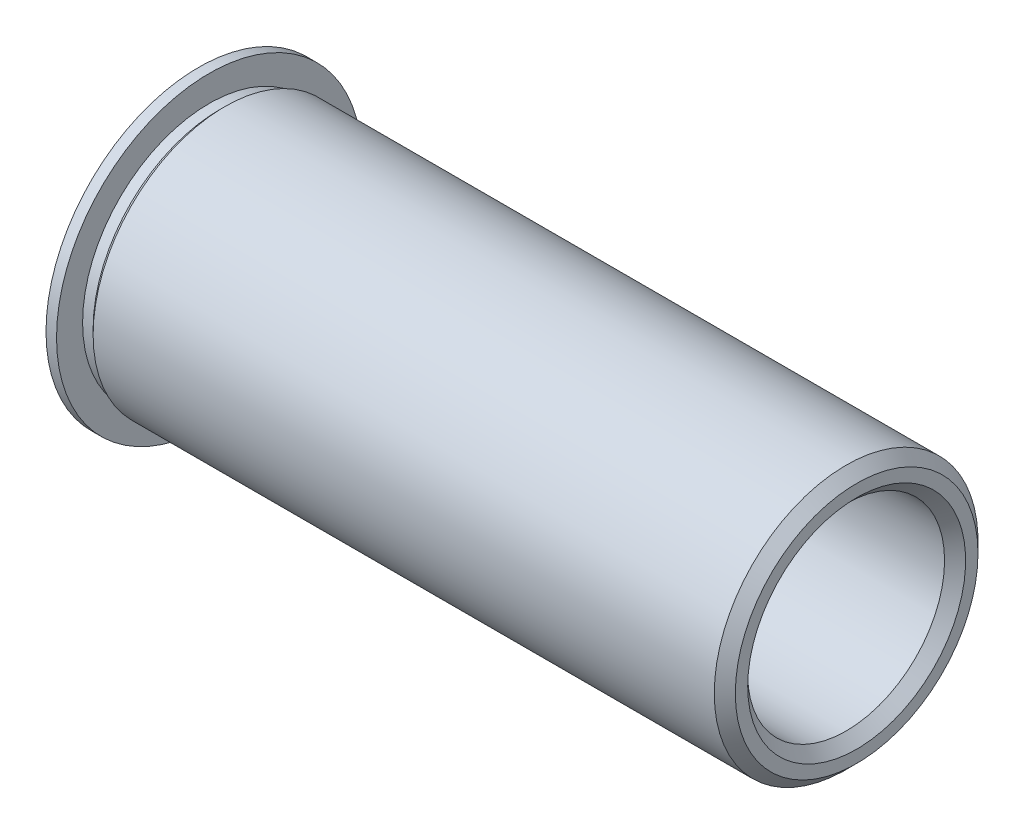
ISO-10303-21;
HEADER;
FILE_DESCRIPTION(('STEP AP214'),'2;1');
FILE_NAME('part.step','',(''),(''),'','','');
FILE_SCHEMA(('AUTOMOTIVE_DESIGN { 1 0 10303 214 1 1 1 1 }'));
ENDSEC;
DATA;
#1=APPLICATION_CONTEXT('core data for automotive mechanical design processes');
#2=APPLICATION_PROTOCOL_DEFINITION('international standard','automotive_design',2000,#1);
#3=PRODUCT_CONTEXT('',#1,'mechanical');
#4=PRODUCT('Part','Part','',(#3));
#5=PRODUCT_RELATED_PRODUCT_CATEGORY('part','',(#4));
#6=PRODUCT_DEFINITION_FORMATION('','',#4);
#7=PRODUCT_DEFINITION_CONTEXT('part definition',#1,'design');
#8=PRODUCT_DEFINITION('design','',#6,#7);
#9=PRODUCT_DEFINITION_SHAPE('','',#8);
#10=(LENGTH_UNIT() NAMED_UNIT(*) SI_UNIT(.MILLI.,.METRE.));
#11=(NAMED_UNIT(*) PLANE_ANGLE_UNIT() SI_UNIT($,.RADIAN.));
#12=(NAMED_UNIT(*) SI_UNIT($,.STERADIAN.) SOLID_ANGLE_UNIT());
#13=UNCERTAINTY_MEASURE_WITH_UNIT(LENGTH_MEASURE(1.E-05),#10,'distance_accuracy_value','');
#14=(GEOMETRIC_REPRESENTATION_CONTEXT(3) GLOBAL_UNCERTAINTY_ASSIGNED_CONTEXT((#13)) GLOBAL_UNIT_ASSIGNED_CONTEXT((#10,
#11,#12)) REPRESENTATION_CONTEXT('',''));
#15=CARTESIAN_POINT('',(0.,0.,0.));
#16=DIRECTION('',(0.,0.,1.));
#17=DIRECTION('',(1.,0.,0.));
#18=AXIS2_PLACEMENT_3D('',#15,#16,#17);
#19=CARTESIAN_POINT('',(-45.0910828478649,95.4400873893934,0.));
#20=DIRECTION('',(-1.,0.,0.));
#21=DIRECTION('',(0.,0.,1.));
#22=AXIS2_PLACEMENT_3D('',#19,#20,#21);
#23=PLANE('',#22);
#24=CARTESIAN_POINT('',(-45.0910828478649,95.4400873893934,0.));
#25=DIRECTION('',(-1.,0.,0.));
#26=DIRECTION('',(0.,0.,1.));
#27=AXIS2_PLACEMENT_3D('',#24,#25,#26);
#28=CIRCLE('',#27,2.6289);
#29=CARTESIAN_POINT('',(-45.0910828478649,95.4400873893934,2.6289));
#30=VERTEX_POINT('',#29);
#31=EDGE_CURVE('E10',#30,#30,#28,.T.);
#32=ORIENTED_EDGE('',*,*,#31,.T.);
#33=EDGE_LOOP('',(#32));
#34=FACE_BOUND('',#33,.T.);
#35=CARTESIAN_POINT('',(-45.0910828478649,95.4400873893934,0.));
#36=DIRECTION('',(-1.,0.,0.));
#37=DIRECTION('',(0.,0.,1.));
#38=AXIS2_PLACEMENT_3D('',#35,#36,#37);
#39=CIRCLE('',#38,2.92735);
#40=CARTESIAN_POINT('',(-45.0910828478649,95.4400873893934,2.92735));
#41=VERTEX_POINT('',#40);
#42=EDGE_CURVE('E52',#41,#41,#39,.T.);
#43=ORIENTED_EDGE('',*,*,#42,.F.);
#44=EDGE_LOOP('',(#43));
#45=FACE_BOUND('',#44,.T.);
#46=ADVANCED_FACE('F32',(#34,#45),#23,.F.);
#47=CARTESIAN_POINT('',(-45.0910828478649,95.4400873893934,0.));
#48=DIRECTION('',(-1.,0.,0.));
#49=DIRECTION('',(0.,0.,1.));
#50=AXIS2_PLACEMENT_3D('',#47,#48,#49);
#51=CONICAL_SURFACE('',#50,2.92735,0.785398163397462);
#52=CARTESIAN_POINT('',(-45.3450828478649,95.4400873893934,0.));
#53=DIRECTION('',(-1.,0.,0.));
#54=DIRECTION('',(0.,0.,1.));
#55=AXIS2_PLACEMENT_3D('',#52,#53,#54);
#56=CIRCLE('',#55,3.18135);
#57=CARTESIAN_POINT('',(-45.3450828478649,95.4400873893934,3.18135));
#58=VERTEX_POINT('',#57);
#59=EDGE_CURVE('E55',#58,#58,#56,.T.);
#60=ORIENTED_EDGE('',*,*,#59,.F.);
#61=EDGE_LOOP('',(#60));
#62=FACE_BOUND('',#61,.T.);
#63=ORIENTED_EDGE('',*,*,#42,.T.);
#64=EDGE_LOOP('',(#63));
#65=FACE_BOUND('',#64,.T.);
#66=ADVANCED_FACE('F103',(#62,#65),#51,.T.);
#67=CARTESIAN_POINT('',(-60.9660828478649,95.4400873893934,0.));
#68=DIRECTION('',(-1.,0.,0.));
#69=DIRECTION('',(0.,0.,1.));
#70=AXIS2_PLACEMENT_3D('',#67,#68,#69);
#71=CYLINDRICAL_SURFACE('',#70,3.18135);
#72=CARTESIAN_POINT('',(-60.331082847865,95.4400873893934,0.));
#73=DIRECTION('',(-1.,0.,0.));
#74=DIRECTION('',(0.,0.,1.));
#75=AXIS2_PLACEMENT_3D('',#72,#73,#74);
#76=CIRCLE('',#75,3.18135);
#77=CARTESIAN_POINT('',(-60.331082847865,95.4400873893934,3.18135));
#78=VERTEX_POINT('',#77);
#79=EDGE_CURVE('E58',#78,#78,#76,.T.);
#80=ORIENTED_EDGE('',*,*,#79,.F.);
#81=EDGE_LOOP('',(#80));
#82=FACE_BOUND('',#81,.T.);
#83=ORIENTED_EDGE('',*,*,#59,.T.);
#84=EDGE_LOOP('',(#83));
#85=FACE_BOUND('',#84,.T.);
#86=ADVANCED_FACE('F97',(#82,#85),#71,.T.);
#87=CARTESIAN_POINT('',(-60.331082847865,95.4400873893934,0.));
#88=DIRECTION('',(1.,0.,0.));
#89=DIRECTION('',(0.,0.,-1.));
#90=AXIS2_PLACEMENT_3D('',#87,#88,#89);
#91=CONICAL_SURFACE('',#90,3.18135,0.785398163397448);
#92=CARTESIAN_POINT('',(-60.458082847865,95.4400873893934,0.));
#93=DIRECTION('',(-1.,0.,0.));
#94=DIRECTION('',(0.,0.,1.));
#95=AXIS2_PLACEMENT_3D('',#92,#93,#94);
#96=CIRCLE('',#95,3.05435);
#97=CARTESIAN_POINT('',(-60.458082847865,95.4400873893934,3.05435));
#98=VERTEX_POINT('',#97);
#99=EDGE_CURVE('E61',#98,#98,#96,.T.);
#100=ORIENTED_EDGE('',*,*,#99,.F.);
#101=EDGE_LOOP('',(#100));
#102=FACE_BOUND('',#101,.T.);
#103=ORIENTED_EDGE('',*,*,#79,.T.);
#104=EDGE_LOOP('',(#103));
#105=FACE_BOUND('',#104,.T.);
#106=ADVANCED_FACE('F91',(#102,#105),#91,.T.);
#107=CARTESIAN_POINT('',(-60.9660828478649,95.4400873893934,0.));
#108=DIRECTION('',(-1.,0.,0.));
#109=DIRECTION('',(0.,0.,1.));
#110=AXIS2_PLACEMENT_3D('',#107,#108,#109);
#111=CYLINDRICAL_SURFACE('',#110,3.05435);
#112=CARTESIAN_POINT('',(-60.712082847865,95.4400873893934,0.));
#113=DIRECTION('',(-1.,0.,0.));
#114=DIRECTION('',(0.,0.,1.));
#115=AXIS2_PLACEMENT_3D('',#112,#113,#114);
#116=CIRCLE('',#115,3.05435);
#117=CARTESIAN_POINT('',(-60.712082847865,95.4400873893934,3.05435));
#118=VERTEX_POINT('',#117);
#119=EDGE_CURVE('E64',#118,#118,#116,.T.);
#120=ORIENTED_EDGE('',*,*,#119,.F.);
#121=EDGE_LOOP('',(#120));
#122=FACE_BOUND('',#121,.T.);
#123=ORIENTED_EDGE('',*,*,#99,.T.);
#124=EDGE_LOOP('',(#123));
#125=FACE_BOUND('',#124,.T.);
#126=ADVANCED_FACE('F85',(#122,#125),#111,.T.);
#127=CARTESIAN_POINT('',(-60.712082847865,98.4944373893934,0.));
#128=DIRECTION('',(-1.,0.,0.));
#129=DIRECTION('',(0.,0.,1.));
#130=AXIS2_PLACEMENT_3D('',#127,#128,#129);
#131=PLANE('',#130);
#132=CARTESIAN_POINT('',(-60.712082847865,95.4400873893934,0.));
#133=DIRECTION('',(-1.,0.,0.));
#134=DIRECTION('',(0.,0.,1.));
#135=AXIS2_PLACEMENT_3D('',#132,#133,#134);
#136=CIRCLE('',#135,3.68299999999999);
#137=CARTESIAN_POINT('',(-60.712082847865,95.4400873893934,3.68299999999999));
#138=VERTEX_POINT('',#137);
#139=EDGE_CURVE('E67',#138,#138,#136,.T.);
#140=ORIENTED_EDGE('',*,*,#139,.F.);
#141=EDGE_LOOP('',(#140));
#142=FACE_BOUND('',#141,.T.);
#143=ORIENTED_EDGE('',*,*,#119,.T.);
#144=EDGE_LOOP('',(#143));
#145=FACE_BOUND('',#144,.T.);
#146=ADVANCED_FACE('F79',(#142,#145),#131,.F.);
#147=CARTESIAN_POINT('',(-60.9660828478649,95.4400873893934,0.));
#148=DIRECTION('',(-1.,0.,0.));
#149=DIRECTION('',(0.,0.,1.));
#150=AXIS2_PLACEMENT_3D('',#147,#148,#149);
#151=CYLINDRICAL_SURFACE('',#150,3.683);
#152=CARTESIAN_POINT('',(-60.9660828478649,95.4400873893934,0.));
#153=DIRECTION('',(-1.,0.,0.));
#154=DIRECTION('',(0.,0.,1.));
#155=AXIS2_PLACEMENT_3D('',#152,#153,#154);
#156=CIRCLE('',#155,3.68300000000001);
#157=CARTESIAN_POINT('',(-60.9660828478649,95.4400873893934,3.68300000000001));
#158=VERTEX_POINT('',#157);
#159=EDGE_CURVE('E70',#158,#158,#156,.T.);
#160=ORIENTED_EDGE('',*,*,#159,.F.);
#161=EDGE_LOOP('',(#160));
#162=FACE_BOUND('',#161,.T.);
#163=ORIENTED_EDGE('',*,*,#139,.T.);
#164=EDGE_LOOP('',(#163));
#165=FACE_BOUND('',#164,.T.);
#166=ADVANCED_FACE('F76',(#162,#165),#151,.T.);
#167=CARTESIAN_POINT('',(-60.9660828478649,95.4400873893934,0.));
#168=DIRECTION('',(1.,0.,0.));
#169=DIRECTION('',(0.,0.,-1.));
#170=AXIS2_PLACEMENT_3D('',#167,#168,#169);
#171=PLANE('',#170);
#172=CARTESIAN_POINT('',(-60.9660828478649,95.4400873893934,0.));
#173=DIRECTION('',(1.,0.,0.));
#174=DIRECTION('',(0.,0.,-1.));
#175=AXIS2_PLACEMENT_3D('',#172,#173,#174);
#176=CIRCLE('',#175,2.62889999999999);
#177=CARTESIAN_POINT('',(-60.9660828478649,95.4400873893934,-2.62889999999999));
#178=VERTEX_POINT('',#177);
#179=EDGE_CURVE('E47',#178,#178,#176,.T.);
#180=ORIENTED_EDGE('',*,*,#179,.T.);
#181=EDGE_LOOP('',(#180));
#182=FACE_BOUND('',#181,.T.);
#183=ORIENTED_EDGE('',*,*,#159,.T.);
#184=EDGE_LOOP('',(#183));
#185=FACE_BOUND('',#184,.T.);
#186=ADVANCED_FACE('F74',(#182,#185),#171,.F.);
#187=CARTESIAN_POINT('',(-60.9660828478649,95.4400873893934,0.));
#188=DIRECTION('',(1.,0.,0.));
#189=DIRECTION('',(0.,0.,-1.));
#190=AXIS2_PLACEMENT_3D('',#187,#188,#189);
#191=CYLINDRICAL_SURFACE('',#190,2.3749);
#192=CARTESIAN_POINT('',(-45.345082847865,95.4400873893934,0.));
#193=DIRECTION('',(-1.,0.,0.));
#194=DIRECTION('',(0.,0.,1.));
#195=AXIS2_PLACEMENT_3D('',#192,#193,#194);
#196=CIRCLE('',#195,2.3749);
#197=CARTESIAN_POINT('',(-45.345082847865,95.4400873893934,2.3749));
#198=VERTEX_POINT('',#197);
#199=EDGE_CURVE('E39',#198,#198,#196,.F.);
#200=ORIENTED_EDGE('',*,*,#199,.T.);
#201=EDGE_LOOP('',(#200));
#202=FACE_BOUND('',#201,.T.);
#203=CARTESIAN_POINT('',(-60.712082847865,95.4400873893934,0.));
#204=DIRECTION('',(1.,0.,0.));
#205=DIRECTION('',(0.,0.,-1.));
#206=AXIS2_PLACEMENT_3D('',#203,#204,#205);
#207=CIRCLE('',#206,2.3749);
#208=CARTESIAN_POINT('',(-60.712082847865,95.4400873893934,-2.3749));
#209=VERTEX_POINT('',#208);
#210=EDGE_CURVE('E43',#209,#209,#207,.F.);
#211=ORIENTED_EDGE('',*,*,#210,.T.);
#212=EDGE_LOOP('',(#211));
#213=FACE_BOUND('',#212,.T.);
#214=ADVANCED_FACE('F118',(#202,#213),#191,.F.);
#215=CARTESIAN_POINT('',(-60.9660828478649,95.4400873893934,0.));
#216=DIRECTION('',(-1.,0.,0.));
#217=DIRECTION('',(0.,0.,1.));
#218=AXIS2_PLACEMENT_3D('',#215,#216,#217);
#219=CONICAL_SURFACE('',#218,2.62889999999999,0.785398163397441);
#220=ORIENTED_EDGE('',*,*,#210,.F.);
#221=EDGE_LOOP('',(#220));
#222=FACE_BOUND('',#221,.T.);
#223=ORIENTED_EDGE('',*,*,#179,.F.);
#224=EDGE_LOOP('',(#223));
#225=FACE_BOUND('',#224,.T.);
#226=ADVANCED_FACE('F116',(#222,#225),#219,.F.);
#227=CARTESIAN_POINT('',(-45.345082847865,95.4400873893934,0.));
#228=DIRECTION('',(1.,0.,0.));
#229=DIRECTION('',(0.,0.,-1.));
#230=AXIS2_PLACEMENT_3D('',#227,#228,#229);
#231=CONICAL_SURFACE('',#230,2.3749,0.785398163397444);
#232=ORIENTED_EDGE('',*,*,#31,.F.);
#233=EDGE_LOOP('',(#232));
#234=FACE_BOUND('',#233,.T.);
#235=ORIENTED_EDGE('',*,*,#199,.F.);
#236=EDGE_LOOP('',(#235));
#237=FACE_BOUND('',#236,.T.);
#238=ADVANCED_FACE('F34',(#234,#237),#231,.F.);
#239=CLOSED_SHELL('',(#46,#66,#86,#106,#126,#146,#166,#186,#214,#226,#238));
#240=MANIFOLD_SOLID_BREP('B2',#239);
#241=ADVANCED_BREP_SHAPE_REPRESENTATION('',(#18,#240),#14);
#242=SHAPE_DEFINITION_REPRESENTATION(#9,#241);
ENDSEC;
END-ISO-10303-21;
